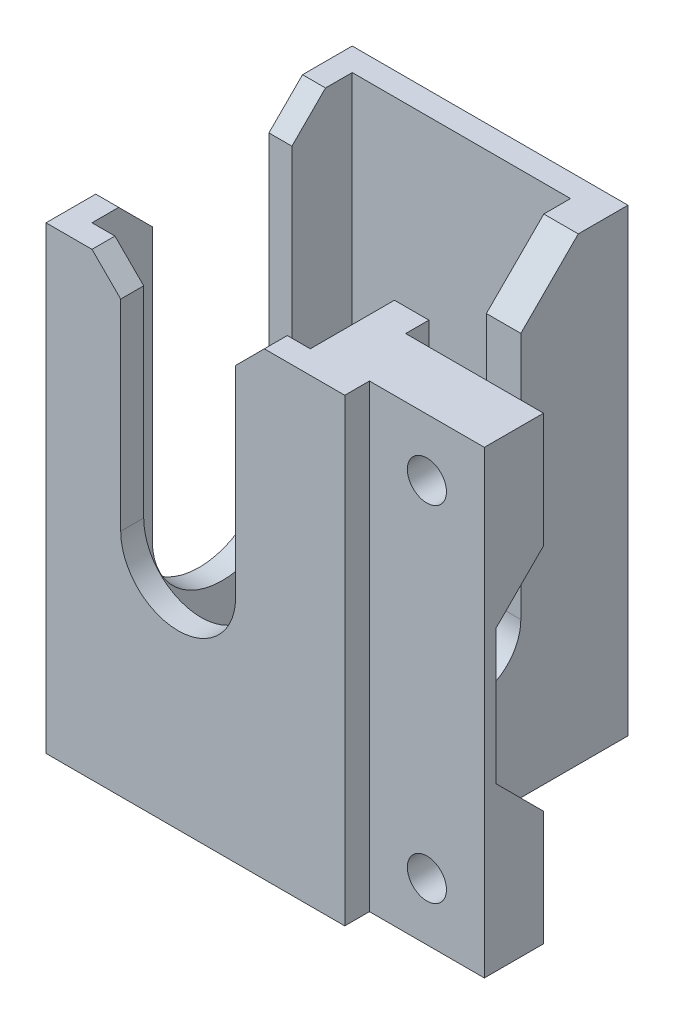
from build123d import *

# Parameters (mm, degrees)
SKETCH1_W                                        = 19
SKETCH1_H                                        = 22.65
BOSS_EXTRUDE1_DEPTH                              = 40
SKETCH2_W                                        = 3.46
SKETCH2_H                                        = 5.5
BOSS_EXTRUDE2_DEPTH                              = 2
CUT_EXTRUDE1_DEPTH                               = 3
CUT_EXTRUDE2_DEPTH                               = 2
CUT_EXTRUDE3_DEPTH                               = 2
CUT_EXTRUDE4_DEPTH                               = 12
CBORE_FOR_M3_PAN_HEAD_MACHINE_SCREW1_D           = 3.4
CBORE_FOR_M3_PAN_HEAD_MACHINE_SCREW1_DEPTH       = 14.978536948
CBORE_FOR_M3_PAN_HEAD_MACHINE_SCREW1_CBORE_D     = 7
CBORE_FOR_M3_PAN_HEAD_MACHINE_SCREW1_CBORE_DEPTH = 2.4
CBORE_FOR_M3_PAN_HEAD_MACHINE_SCREW1_TIP         = 1.021463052
SKETCH11_R                                       = 1.7
CUT_EXTRUDE5_DEPTH                               = 2
CHAMFER2_SIZE                                    = 5
CUT_EXTRUDE6_DEPTH                               = 2
CHAMFER3_SIZE                                    = 2.5


with BuildPart() as part:
    # Sketch1 → Boss-Extrude1 (new body)
    with BuildSketch(Plane(origin=(0, 0, 0), x_dir=(1, 0, 0), z_dir=(0, 1, 0))):
        Polygon((-14.5, -13.325), (11.5, -13.325), (11.5, 13.325), (-12.5, 13.325), (-12.5, -6.025), (-24.5, -6.025), (-24.5, -11.175), (-14.5, -11.175), align=None)
        Rectangle(SKETCH1_W, SKETCH1_H, mode=Mode.SUBTRACT)
    extrude(amount=BOSS_EXTRUDE1_DEPTH)

    # Sketch2 → Boss-Extrude2 (add)
    with BuildSketch(Plane.XZ):
        Polygon((-14.5, 13.325), (-14.5, 11.175), (-24.5, 11.175), (-24.5, 6.025), (-12.5, 6.025), (-12.5, -13.325), (11.5, -13.325), (11.5, 13.325), align=None)
        Rectangle(SKETCH2_W, SKETCH2_H, mode=Mode.SUBTRACT)
    extrude(amount=-BOSS_EXTRUDE2_DEPTH)

    # Sketch3 → Cut-Extrude1 (cut)
    with BuildSketch(Plane.ZY.offset(12.5)):
        with BuildLine():
            Line((4, 46.445950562), (4, 13.43))
            ThreePointArc((4, 13.43), (0, 9.43), (-4, 13.43))
            Line((-4, 13.43), (-4, 46.445950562))
            ThreePointArc((-4, 46.445950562), (0, 50.445950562), (4, 46.445950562))
        make_face()
    extrude(amount=-CUT_EXTRUDE1_DEPTH, mode=Mode.SUBTRACT)

    # Sketch4 → Cut-Extrude2 (cut)
    with BuildSketch(Plane.ZY.offset(-9.5)):
        with BuildLine():
            Line((6.075, 43.362668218), (6.075, 13.43))
            ThreePointArc((6.075, 13.43), (0, 7.355), (-6.075, 13.43))
            Line((-6.075, 13.43), (-6.075, 43.362668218))
            ThreePointArc((-6.075, 43.362668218), (0, 49.437668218), (6.075, 43.362668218))
        make_face()
    extrude(amount=-CUT_EXTRUDE2_DEPTH, mode=Mode.SUBTRACT)

    # Sketch5 → Cut-Extrude3 (cut)
    with BuildSketch(Plane.XY.offset(13.325)):
        with BuildLine():
            Line((5, 47.930635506), (5, 20))
            ThreePointArc((5, 20), (0, 15), (-5, 20))
            Line((-5, 20), (-5, 47.930635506))
            ThreePointArc((-5, 47.930635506), (0, 52.930635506), (5, 47.930635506))
        make_face()
    extrude(amount=-CUT_EXTRUDE3_DEPTH, mode=Mode.SUBTRACT)

    # Sketch7 → Cut-Extrude4 (cut)
    with BuildSketch(Plane.ZY.offset(24.5)):
        Polygon((6.025, 30), (10.175, 25.85), (10.175, 14.15), (6.025, 10), align=None)
    extrude(amount=-CUT_EXTRUDE4_DEPTH, mode=Mode.SUBTRACT)

    # CBORE for M3 Pan Head Machine Screw1
    with Locations(Plane(origin=(0, 0, 6.025), x_dir=(-1, 0, 0), z_dir=(0, 0, -1))):
        with Locations((19.5, 35), (19.5, 5)):
            CounterBoreHole(CBORE_FOR_M3_PAN_HEAD_MACHINE_SCREW1_D / 2, CBORE_FOR_M3_PAN_HEAD_MACHINE_SCREW1_CBORE_D / 2, CBORE_FOR_M3_PAN_HEAD_MACHINE_SCREW1_CBORE_DEPTH, depth=CBORE_FOR_M3_PAN_HEAD_MACHINE_SCREW1_DEPTH)
            with Locations((0, 0, -(CBORE_FOR_M3_PAN_HEAD_MACHINE_SCREW1_DEPTH + CBORE_FOR_M3_PAN_HEAD_MACHINE_SCREW1_TIP / 2))):  # 118° drill point
                Cone(0, CBORE_FOR_M3_PAN_HEAD_MACHINE_SCREW1_D / 2, CBORE_FOR_M3_PAN_HEAD_MACHINE_SCREW1_TIP, mode=Mode.SUBTRACT)

    # Sketch11 → Cut-Extrude5 (cut)
    with BuildSketch(Plane(origin=(0, 0, -13.325), x_dir=(-1, 0, 0), z_dir=(0, 0, -1))):
        with Locations((0, 20)):
            Circle(SKETCH11_R)
    extrude(amount=-CUT_EXTRUDE5_DEPTH, mode=Mode.SUBTRACT)

    # Chamfer2
    chamfer2_edges = [part.edges().sort_by_distance(p)[0] for p in [
        (-11, 40, -4),
    ]]
    chamfer(chamfer2_edges, length=CHAMFER2_SIZE)

    # Sketch12 → Cut-Extrude6 (cut)
    with BuildSketch(Plane(origin=(11.5, 0, 0), x_dir=(0, 0, -1), z_dir=(1, 0, 0))):
        Polygon((4, 35), (9, 40), (4, 40), align=None)
        Polygon((-4, 40), (-4, 35), (-9, 40), align=None)
    extrude(amount=-CUT_EXTRUDE6_DEPTH, mode=Mode.SUBTRACT)

    # Chamfer3
    chamfer3_edges = [part.edges().sort_by_distance(p)[0] for p in [
        (5, 40, 12.325),
        (-5, 40, 12.325),
    ]]
    chamfer(chamfer3_edges, length=CHAMFER3_SIZE)


with BuildPart() as body_2:
    # Mirror1: mirrored copy
    add(part.part.mirror(Plane(origin=(11.5, 40, 13.325), x_dir=(0, 0, 1), z_dir=(-1, 0, 0))))


solid = body_2.part
